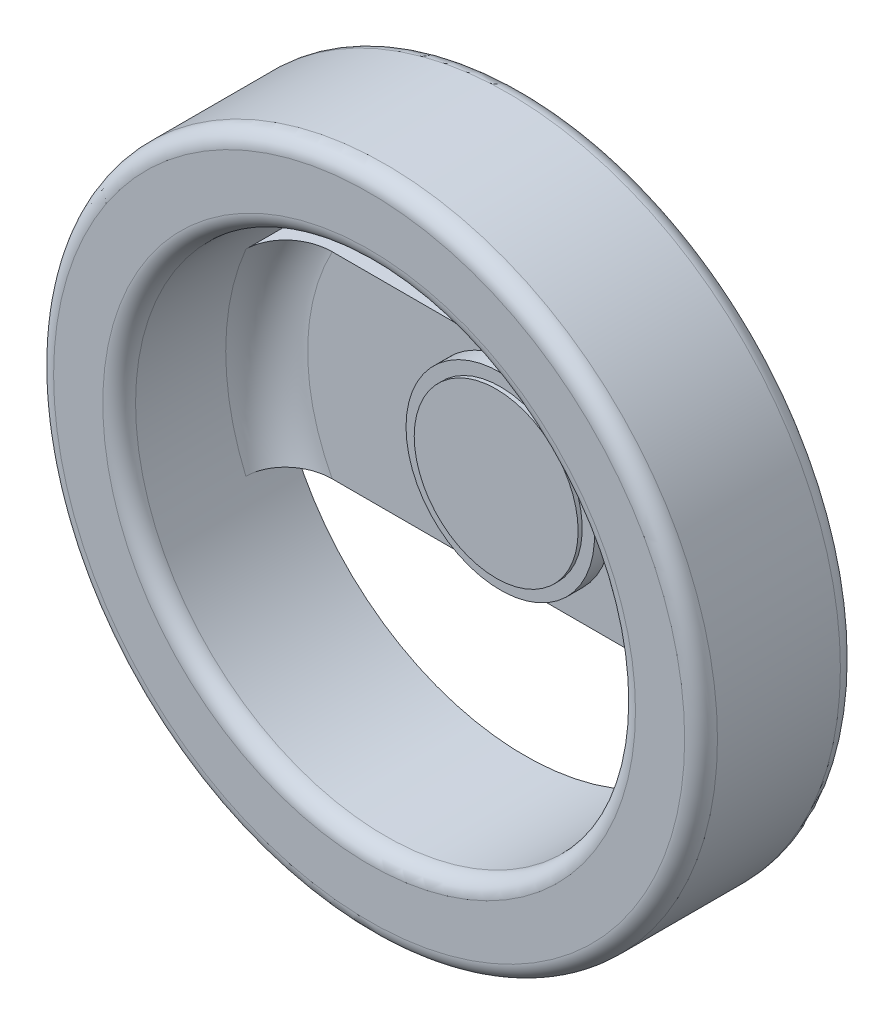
from build123d import *

# Parameters (mm, degrees)
ESQUISSE1_R             = 40.5
ESQUISSE1_R_2           = 30.5
BASE_EXTRUSION_DEPTH    = 19
BOSS_EXTRU_1_DEPTH      = 1
BOSS_EXTRU_2_DEPTH      = 16
BOSS_EXTRU_2_DEPTH_BACK = 3
ESQUISSE5_R             = 11.5
BOSS_EXTRU_3_DEPTH      = 24
CONG_2_R                = 5
CONG_3_R                = 2
CONG_6_R                = 2
ESQUISSE7_R             = 4
ENL_V_MAT_EXTRU_1_DEPTH = 17
ESQUISSE8_R             = 10
BOSS_EXTRU_4_DEPTH      = 0.5


with BuildPart() as part:
    # Esquisse1 → Base-Extrusion (new body)
    with BuildSketch(Plane.XY):
        Circle(ESQUISSE1_R)
        Circle(ESQUISSE1_R_2, mode=Mode.SUBTRACT)
    extrude(amount=BASE_EXTRUSION_DEPTH)

    # Esquisse4 → Boss.-Extru.1 (add)
    with BuildSketch(Plane(origin=(0, 0, 0), x_dir=(-1, 0, 0), z_dir=(0, 0, -1))):
        with BuildLine():
            Line((38.681390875, -12), (-38.681390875, -12))
            ThreePointArc((-38.681390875, -12), (-40.5, 0), (-38.681390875, 12))
            Line((-38.681390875, 12), (38.681390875, 12))
            ThreePointArc((38.681390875, 12), (40.5, 0), (38.681390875, -12))
        make_face()
    extrude(amount=-BOSS_EXTRU_1_DEPTH)

    # Esquisse5 → Boss.-Extru.2 (add, two sides: drawn at the far end of the back side and taken through both)
    with BuildSketch(Plane(origin=(0, 0, 0), x_dir=(-1, 0, 0), z_dir=(0, 0, -1)).offset(-BOSS_EXTRU_2_DEPTH_BACK)):
        Circle(ESQUISSE5_R)
    extrude(amount=BOSS_EXTRU_2_DEPTH + BOSS_EXTRU_2_DEPTH_BACK)

    # Esquisse6 → Boss.-Extru.3 (add)
    with BuildSketch(Plane.XZ.offset(12)):
        Polygon((-28.040149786, 0), (-2.30606674, -12), (2.30606674, -12), (28.040149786, 0), align=None)
    extrude(amount=-BOSS_EXTRU_3_DEPTH)

    # Cong_2
    cong_2_edges = [part.edges().sort_by_distance(p)[0] for p in [
        (-30.5, 0, 1),
        (29.878709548, 6.124762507, 1),
    ]]
    fillet(cong_2_edges, radius=CONG_2_R)

    # Cong_3
    cong_3_edges = [part.edges().sort_by_distance(p)[0] for p in [
        (-40.5, 0, 19),
        (-30.5, 0, 19),
    ]]
    fillet(cong_3_edges, radius=CONG_3_R)

    # Cong_6
    cong_6_edges = [part.edges().sort_by_distance(p)[0] for p in [
        (-40.5, 0, 0),
    ]]
    fillet(cong_6_edges, radius=CONG_6_R)

    # Esquisse7 → Enl_v. mat.-Extru.1 (cut)
    with BuildSketch(Plane(origin=(0, 0, -16), x_dir=(-1, 0, 0), z_dir=(0, 0, -1))):
        Circle(ESQUISSE7_R)
    extrude(amount=-ENL_V_MAT_EXTRU_1_DEPTH, mode=Mode.SUBTRACT)

    # Esquisse8 → Boss.-Extru.4 (add)
    with BuildSketch(Plane.XY.offset(3)):
        with Locations(Location((0, 0, 0), (0, 0, 180))):
            Circle(ESQUISSE8_R)
    extrude(amount=BOSS_EXTRU_4_DEPTH)


solid = part.part
